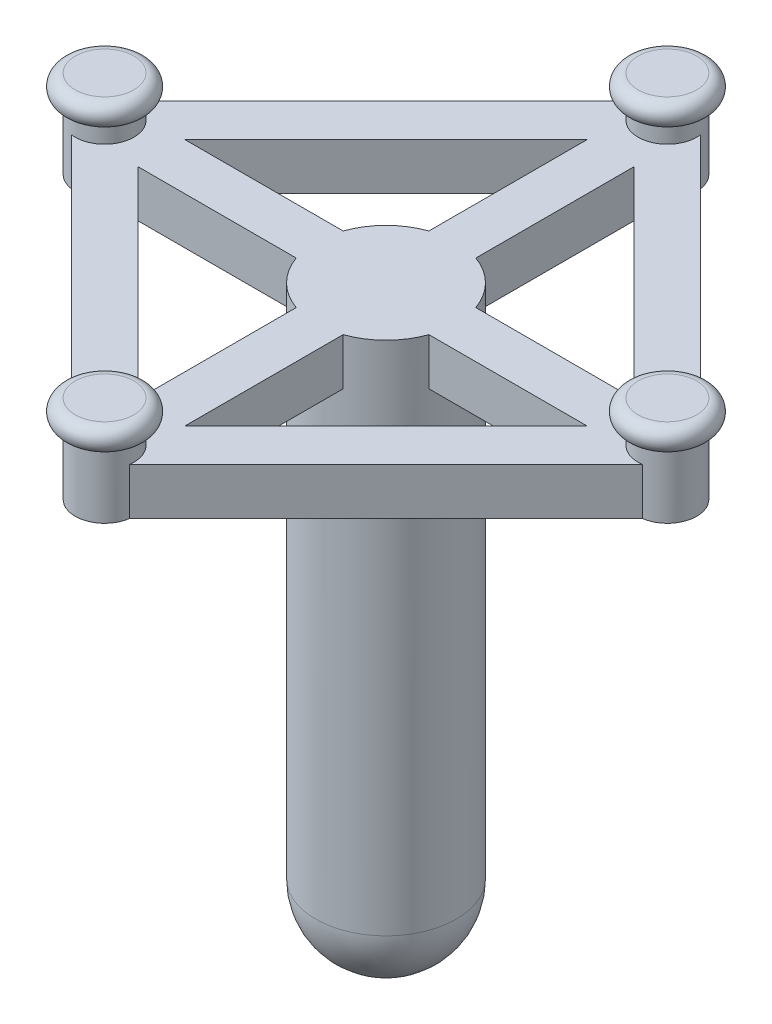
from build123d import *

# Parameters (mm, degrees)
BOSS_EXTRUDE1_DEPTH      = 2
BOSS_EXTRUDE2_START      = -2
SKETCH2_R                = 1.25
BOSS_EXTRUDE2_DEPTH      = 3.75
CUT_EXTRUDE2_DEPTH       = 2
CIRPATTERN1_COUNT        = 4
BOSS_EXTRUDE3_DEPTH      = 2
CIRPATTERN2_COUNT        = 4
BOSS_EXTRUDE4_DEPTH      = 20
BOSS_EXTRUDE4_DEPTH_BACK = 2
SKETCH8_R                = 3
DOME1_FACE_RADIUS        = 3
DOME1_HEIGHT             = 3


with BuildPart() as part:
    # Sketch1 → Boss-Extrude1 (new body)
    # profile 1 of 2: a face of its own
    with BuildSketch(Plane(origin=(0, 0, 0), x_dir=(1, 0, 0), z_dir=(0, 1, 0))):
        Polygon((-13.414213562, 0), (0, -13.414213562), (13.414213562, 0), (0, 13.414213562), align=None)
        Polygon((0, -12), (12, 0), (0, 12), (-12, 0), align=None, mode=Mode.SUBTRACT)
    # profile 2 of 2: a face of its own
    with BuildSketch(Plane(origin=(0, 0, 0), x_dir=(1, 0, 0), z_dir=(0, 1, 0))):
        Polygon((-12, 0), (0, -12), (12, 0), (0, 12), align=None)
        Polygon((0, -10.585786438), (10.585786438, 0), (0, 10.585786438), (-10.585786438, 0), align=None, mode=Mode.SUBTRACT)
    extrude(amount=BOSS_EXTRUDE1_DEPTH)

    # Sketch2 → Boss-Extrude2 (add)
    with BuildSketch(Plane(origin=(0, 2, 0), x_dir=(1, 0, 0), z_dir=(0, 1, 0)).offset(BOSS_EXTRUDE2_START)):
        with Locations(Location((0, 12, 0), (0, 0, 270))):
            Circle(SKETCH2_R)
    boss_extrude2 = extrude(amount=BOSS_EXTRUDE2_DEPTH)

    # Sketch4 → Revolve1 (revolve)
    with BuildSketch(Plane(origin=(0, 0, 0), x_dir=(0, 0, -1), z_dir=(1, 0, 0)), mode=Mode.PRIVATE) as revolve1_sk:
        with BuildLine():
            Line((12, 3.75), (13.25, 3.75))
            ThreePointArc((13.25, 3.75), (13.75, 3.25), (13.25, 2.75))
            Line((13.25, 2.75), (12, 2.75))
            Line((12, 2.75), (12, 3.75))
        make_face()
    revolve1 = revolve(revolve1_sk.sketch.rotate(Axis((0, 0, -12), (0, 1, 0)), 81.869897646), axis=Axis((0, 0, -12), (0, 1, 0)))

    # Sketch10 → Cut-Extrude2 (cut)
    with BuildSketch(Plane.XZ):
        with BuildLine():
            Line((0, -13.414213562), (0.176776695, -13.237436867))
            ThreePointArc((0.176776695, -13.237436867), (0, -13.25), (-0.176776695, -13.237436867))
            Line((-0.176776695, -13.237436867), (0, -13.414213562))
        make_face()
    cut_extrude2 = extrude(amount=-CUT_EXTRUDE2_DEPTH, mode=Mode.SUBTRACT)

    # CirPattern1: Boss-Extrude2, Revolve1, Cut-Extrude2 ×4 about axis
    cirpattern1_axis = Axis((0, 0, 0), (0, 1, 0))
    add([boss_extrude2.rotate(cirpattern1_axis, i * 360 / CIRPATTERN1_COUNT) for i in range(1, CIRPATTERN1_COUNT)])
    add([revolve1.rotate(cirpattern1_axis, i * 360 / CIRPATTERN1_COUNT) for i in range(1, CIRPATTERN1_COUNT)])
    add([cut_extrude2.rotate(cirpattern1_axis, i * 360 / CIRPATTERN1_COUNT) for i in range(1, CIRPATTERN1_COUNT)], mode=Mode.SUBTRACT)

    # Sketch7 → Boss-Extrude3 (add)
    with BuildSketch(Plane(origin=(0, 0, 0), x_dir=(1, 0, 0), z_dir=(0, 1, 0))):
        Polygon((0, 0), (1, 0), (1, 11), (-1, 11), (-1, 0), align=None)
    boss_extrude3 = extrude(amount=BOSS_EXTRUDE3_DEPTH)

    # CirPattern2: Boss-Extrude3 ×4 about axis
    cirpattern2_axis = Axis((0, 0, 0), (0, 1, 0))
    for i in range(1, CIRPATTERN2_COUNT):
        add(boss_extrude3.rotate(cirpattern2_axis, i * 360 / CIRPATTERN2_COUNT))

    # Sketch8 → Boss-Extrude4 (add, two sides: drawn at the far end of the back side and taken through both)
    with BuildSketch(Plane.XZ.offset(-BOSS_EXTRUDE4_DEPTH_BACK)):
        with Locations(Location((0, 0, 0), (0, 0, 270))):
            Circle(SKETCH8_R)
    extrude(amount=BOSS_EXTRUDE4_DEPTH + BOSS_EXTRUDE4_DEPTH_BACK)

    # Dome1: a dome of height H over a round flat face of radius A is a cap of a sphere of radius (A * A + H * H) / (2 * H)
    dome1_r = (DOME1_FACE_RADIUS * DOME1_FACE_RADIUS + DOME1_HEIGHT * DOME1_HEIGHT) / (2 * DOME1_HEIGHT)
    dome1_base = Plane((0, -20, 0), z_dir=(0, -1, 0))
    with Locations(dome1_base.offset(DOME1_HEIGHT - dome1_r)):
        dome1_ball = Sphere(dome1_r, mode=Mode.PRIVATE)
    add(split(dome1_ball, bisect_by=dome1_base, keep=Keep.TOP, mode=Mode.PRIVATE))


solid = part.part
